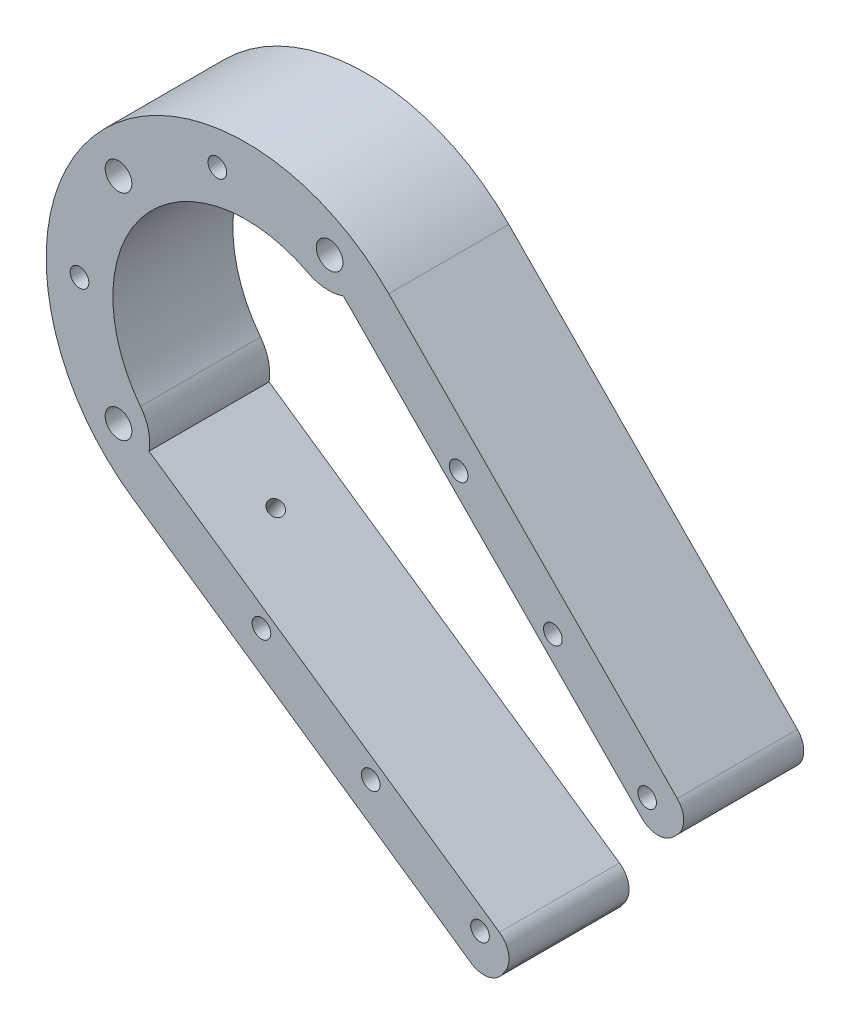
ISO-10303-21;
HEADER;
FILE_DESCRIPTION(('STEP AP214'),'2;1');
FILE_NAME('part.step','',(''),(''),'','','');
FILE_SCHEMA(('AUTOMOTIVE_DESIGN { 1 0 10303 214 1 1 1 1 }'));
ENDSEC;
DATA;
#1=APPLICATION_CONTEXT('core data for automotive mechanical design processes');
#2=APPLICATION_PROTOCOL_DEFINITION('international standard','automotive_design',2000,#1);
#3=PRODUCT_CONTEXT('',#1,'mechanical');
#4=PRODUCT('Part','Part','',(#3));
#5=PRODUCT_RELATED_PRODUCT_CATEGORY('part','',(#4));
#6=PRODUCT_DEFINITION_FORMATION('','',#4);
#7=PRODUCT_DEFINITION_CONTEXT('part definition',#1,'design');
#8=PRODUCT_DEFINITION('design','',#6,#7);
#9=PRODUCT_DEFINITION_SHAPE('','',#8);
#10=(LENGTH_UNIT() NAMED_UNIT(*) SI_UNIT(.MILLI.,.METRE.));
#11=(NAMED_UNIT(*) PLANE_ANGLE_UNIT() SI_UNIT($,.RADIAN.));
#12=(NAMED_UNIT(*) SI_UNIT($,.STERADIAN.) SOLID_ANGLE_UNIT());
#13=UNCERTAINTY_MEASURE_WITH_UNIT(LENGTH_MEASURE(1.E-05),#10,'distance_accuracy_value','');
#14=(GEOMETRIC_REPRESENTATION_CONTEXT(3) GLOBAL_UNCERTAINTY_ASSIGNED_CONTEXT((#13)) GLOBAL_UNIT_ASSIGNED_CONTEXT((#10,
#11,#12)) REPRESENTATION_CONTEXT('',''));
#15=CARTESIAN_POINT('',(0.,0.,0.));
#16=DIRECTION('',(0.,0.,1.));
#17=DIRECTION('',(1.,0.,0.));
#18=AXIS2_PLACEMENT_3D('',#15,#16,#17);
#19=CARTESIAN_POINT('',(18.75,32.4759526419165,9.999));
#20=DIRECTION('',(0.,0.,1.));
#21=DIRECTION('',(1.,0.,0.));
#22=AXIS2_PLACEMENT_3D('',#19,#20,#21);
#23=CYLINDRICAL_SURFACE('',#22,2.1);
#24=CARTESIAN_POINT('',(18.75,32.4759526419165,29.));
#25=DIRECTION('',(0.,0.,1.));
#26=DIRECTION('',(1.,0.,0.));
#27=AXIS2_PLACEMENT_3D('',#24,#25,#26);
#28=CIRCLE('',#27,2.1);
#29=CARTESIAN_POINT('',(20.85,32.4759526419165,29.));
#30=VERTEX_POINT('',#29);
#31=EDGE_CURVE('E195',#30,#30,#28,.F.);
#32=ORIENTED_EDGE('',*,*,#31,.F.);
#33=EDGE_LOOP('',(#32));
#34=FACE_BOUND('',#33,.T.);
#35=CARTESIAN_POINT('',(18.75,32.4759526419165,18.));
#36=DIRECTION('',(0.,0.,-1.));
#37=DIRECTION('',(-1.,0.,0.));
#38=AXIS2_PLACEMENT_3D('',#35,#36,#37);
#39=CIRCLE('',#38,2.1);
#40=CARTESIAN_POINT('',(16.65,32.4759526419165,18.));
#41=VERTEX_POINT('',#40);
#42=EDGE_CURVE('E45',#41,#41,#39,.F.);
#43=ORIENTED_EDGE('',*,*,#42,.F.);
#44=EDGE_LOOP('',(#43));
#45=FACE_BOUND('',#44,.T.);
#46=ADVANCED_FACE('F41',(#34,#45),#23,.F.);
#47=CARTESIAN_POINT('',(-28.7266666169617,24.1045353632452,9.999));
#48=DIRECTION('',(0.,0.,1.));
#49=DIRECTION('',(1.,0.,0.));
#50=AXIS2_PLACEMENT_3D('',#47,#48,#49);
#51=CYLINDRICAL_SURFACE('',#50,2.1);
#52=CARTESIAN_POINT('',(-28.7266666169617,24.1045353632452,29.));
#53=DIRECTION('',(0.,0.,1.));
#54=DIRECTION('',(1.,0.,0.));
#55=AXIS2_PLACEMENT_3D('',#52,#53,#54);
#56=CIRCLE('',#55,2.1);
#57=CARTESIAN_POINT('',(-26.6266666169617,24.1045353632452,29.));
#58=VERTEX_POINT('',#57);
#59=EDGE_CURVE('E191',#58,#58,#56,.F.);
#60=ORIENTED_EDGE('',*,*,#59,.F.);
#61=EDGE_LOOP('',(#60));
#62=FACE_BOUND('',#61,.T.);
#63=CARTESIAN_POINT('',(-28.7266666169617,24.1045353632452,18.));
#64=DIRECTION('',(0.,0.,-1.));
#65=DIRECTION('',(-1.,0.,0.));
#66=AXIS2_PLACEMENT_3D('',#63,#64,#65);
#67=CIRCLE('',#66,2.1);
#68=CARTESIAN_POINT('',(-30.8266666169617,24.1045353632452,18.));
#69=VERTEX_POINT('',#68);
#70=EDGE_CURVE('E206',#69,#69,#67,.F.);
#71=ORIENTED_EDGE('',*,*,#70,.F.);
#72=EDGE_LOOP('',(#71));
#73=FACE_BOUND('',#72,.T.);
#74=ADVANCED_FACE('F412',(#62,#73),#51,.F.);
#75=CARTESIAN_POINT('',(-28.7266666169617,-24.1045353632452,9.999));
#76=DIRECTION('',(0.,0.,1.));
#77=DIRECTION('',(1.,0.,0.));
#78=AXIS2_PLACEMENT_3D('',#75,#76,#77);
#79=CYLINDRICAL_SURFACE('',#78,2.1);
#80=CARTESIAN_POINT('',(-28.7266666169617,-24.1045353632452,29.));
#81=DIRECTION('',(0.,0.,1.));
#82=DIRECTION('',(1.,0.,0.));
#83=AXIS2_PLACEMENT_3D('',#80,#81,#82);
#84=CIRCLE('',#83,2.1);
#85=CARTESIAN_POINT('',(-26.6266666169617,-24.1045353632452,29.));
#86=VERTEX_POINT('',#85);
#87=EDGE_CURVE('E188',#86,#86,#84,.F.);
#88=ORIENTED_EDGE('',*,*,#87,.F.);
#89=EDGE_LOOP('',(#88));
#90=FACE_BOUND('',#89,.T.);
#91=CARTESIAN_POINT('',(-28.7266666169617,-24.1045353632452,18.));
#92=DIRECTION('',(0.,0.,-1.));
#93=DIRECTION('',(-1.,0.,0.));
#94=AXIS2_PLACEMENT_3D('',#91,#92,#93);
#95=CIRCLE('',#94,2.1);
#96=CARTESIAN_POINT('',(-30.8266666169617,-24.1045353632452,18.));
#97=VERTEX_POINT('',#96);
#98=EDGE_CURVE('E204',#97,#97,#95,.F.);
#99=ORIENTED_EDGE('',*,*,#98,.F.);
#100=EDGE_LOOP('',(#99));
#101=FACE_BOUND('',#100,.T.);
#102=ADVANCED_FACE('F419',(#90,#101),#79,.F.);
#103=CARTESIAN_POINT('',(65.0622498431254,67.977292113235,23.5));
#104=DIRECTION('',(-0.567441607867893,-0.823413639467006,0.));
#105=DIRECTION('',(0.823413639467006,-0.567441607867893,0.));
#106=AXIS2_PLACEMENT_3D('',#103,#104,#105);
#107=CYLINDRICAL_SURFACE('',#106,1.7);
#108=CARTESIAN_POINT('',(-6.85529783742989,-36.3821500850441,23.5));
#109=DIRECTION('',(-0.567441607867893,-0.823413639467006,0.));
#110=DIRECTION('',(0.823413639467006,-0.567441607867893,0.));
#111=AXIS2_PLACEMENT_3D('',#108,#109,#110);
#112=CIRCLE('',#111,1.7);
#113=CARTESIAN_POINT('',(-5.45549465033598,-37.3468008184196,23.5));
#114=VERTEX_POINT('',#113);
#115=EDGE_CURVE('E243',#114,#114,#112,.F.);
#116=ORIENTED_EDGE('',*,*,#115,.T.);
#117=EDGE_LOOP('',(#116));
#118=FACE_BOUND('',#117,.T.);
#119=CARTESIAN_POINT('',(-11.4813429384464,-43.0949969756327,23.5));
#120=DIRECTION('',(-0.567441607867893,-0.823413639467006,0.));
#121=DIRECTION('',(0.823413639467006,-0.567441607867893,0.));
#122=AXIS2_PLACEMENT_3D('',#119,#120,#121);
#123=CIRCLE('',#122,1.7);
#124=CARTESIAN_POINT('',(-10.0815397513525,-44.0596477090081,23.5));
#125=VERTEX_POINT('',#124);
#126=EDGE_CURVE('E198',#125,#125,#123,.T.);
#127=ORIENTED_EDGE('',*,*,#126,.T.);
#128=EDGE_LOOP('',(#127));
#129=FACE_BOUND('',#128,.T.);
#130=ADVANCED_FACE('F435',(#118,#129),#107,.F.);
#131=CARTESIAN_POINT('',(0.,0.,37.));
#132=DIRECTION('',(0.,0.,1.));
#133=DIRECTION('',(1.,0.,0.));
#134=AXIS2_PLACEMENT_3D('',#131,#132,#133);
#135=PLANE('',#134);
#136=CARTESIAN_POINT('',(18.75,32.4759526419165,37.));
#137=DIRECTION('',(0.,0.,1.));
#138=DIRECTION('',(1.,0.,0.));
#139=AXIS2_PLACEMENT_3D('',#136,#137,#138);
#140=CIRCLE('',#139,3.);
#141=CARTESIAN_POINT('',(21.75,32.4759526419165,37.));
#142=VERTEX_POINT('',#141);
#143=EDGE_CURVE('E223',#142,#142,#140,.T.);
#144=ORIENTED_EDGE('',*,*,#143,.F.);
#145=EDGE_LOOP('',(#144));
#146=FACE_BOUND('',#145,.T.);
#147=CARTESIAN_POINT('',(-28.7266666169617,24.1045353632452,37.));
#148=DIRECTION('',(0.,0.,1.));
#149=DIRECTION('',(1.,0.,0.));
#150=AXIS2_PLACEMENT_3D('',#147,#148,#149);
#151=CIRCLE('',#150,3.);
#152=CARTESIAN_POINT('',(-25.7266666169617,24.1045353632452,37.));
#153=VERTEX_POINT('',#152);
#154=EDGE_CURVE('E226',#153,#153,#151,.T.);
#155=ORIENTED_EDGE('',*,*,#154,.F.);
#156=EDGE_LOOP('',(#155));
#157=FACE_BOUND('',#156,.T.);
#158=CARTESIAN_POINT('',(-28.7266666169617,-24.1045353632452,37.));
#159=DIRECTION('',(0.,0.,1.));
#160=DIRECTION('',(1.,0.,0.));
#161=AXIS2_PLACEMENT_3D('',#158,#159,#160);
#162=CIRCLE('',#161,3.);
#163=CARTESIAN_POINT('',(-25.7266666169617,-24.1045353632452,37.));
#164=VERTEX_POINT('',#163);
#165=EDGE_CURVE('E232',#164,#164,#162,.T.);
#166=ORIENTED_EDGE('',*,*,#165,.F.);
#167=EDGE_LOOP('',(#166));
#168=FACE_BOUND('',#167,.T.);
#169=CARTESIAN_POINT('',(52.5843615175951,-82.298859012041,37.));
#170=DIRECTION('',(0.,0.,1.));
#171=DIRECTION('',(1.,0.,0.));
#172=AXIS2_PLACEMENT_3D('',#169,#170,#171);
#173=CIRCLE('',#172,2.1);
#174=CARTESIAN_POINT('',(54.6843615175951,-82.298859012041,37.));
#175=VERTEX_POINT('',#174);
#176=EDGE_CURVE('E249',#175,#175,#173,.T.);
#177=ORIENTED_EDGE('',*,*,#176,.F.);
#178=EDGE_LOOP('',(#177));
#179=FACE_BOUND('',#178,.T.);
#180=CARTESIAN_POINT('',(28.0038552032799,-65.1000593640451,37.));
#181=DIRECTION('',(0.,0.,1.));
#182=DIRECTION('',(1.,0.,0.));
#183=AXIS2_PLACEMENT_3D('',#180,#181,#182);
#184=CIRCLE('',#183,2.1);
#185=CARTESIAN_POINT('',(30.1038552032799,-65.1000593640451,37.));
#186=VERTEX_POINT('',#185);
#187=EDGE_CURVE('E253',#186,#186,#184,.T.);
#188=ORIENTED_EDGE('',*,*,#187,.F.);
#189=EDGE_LOOP('',(#188));
#190=FACE_BOUND('',#189,.T.);
#191=CARTESIAN_POINT('',(3.42334888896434,-47.9012597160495,37.));
#192=DIRECTION('',(0.,0.,1.));
#193=DIRECTION('',(1.,0.,0.));
#194=AXIS2_PLACEMENT_3D('',#191,#192,#193);
#195=CIRCLE('',#194,2.1);
#196=CARTESIAN_POINT('',(5.52334888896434,-47.9012597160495,37.));
#197=VERTEX_POINT('',#196);
#198=EDGE_CURVE('E260',#197,#197,#195,.T.);
#199=ORIENTED_EDGE('',*,*,#198,.F.);
#200=EDGE_LOOP('',(#199));
#201=FACE_BOUND('',#200,.T.);
#202=CARTESIAN_POINT('',(-37.5,0.,37.));
#203=DIRECTION('',(0.,0.,1.));
#204=DIRECTION('',(1.,0.,0.));
#205=AXIS2_PLACEMENT_3D('',#202,#203,#204);
#206=CIRCLE('',#205,2.1);
#207=CARTESIAN_POINT('',(-35.4,0.,37.));
#208=VERTEX_POINT('',#207);
#209=EDGE_CURVE('E266',#208,#208,#206,.T.);
#210=ORIENTED_EDGE('',*,*,#209,.F.);
#211=EDGE_LOOP('',(#210));
#212=FACE_BOUND('',#211,.T.);
#213=CARTESIAN_POINT('',(-6.51180666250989,36.9302907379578,37.));
#214=DIRECTION('',(0.,0.,1.));
#215=DIRECTION('',(1.,0.,0.));
#216=AXIS2_PLACEMENT_3D('',#213,#214,#215);
#217=CIRCLE('',#216,2.1);
#218=CARTESIAN_POINT('',(-4.41180666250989,36.9302907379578,37.));
#219=VERTEX_POINT('',#218);
#220=EDGE_CURVE('E272',#219,#219,#217,.T.);
#221=ORIENTED_EDGE('',*,*,#220,.F.);
#222=EDGE_LOOP('',(#221));
#223=FACE_BOUND('',#222,.T.);
#224=CARTESIAN_POINT('',(47.7679902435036,4.94662593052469,37.));
#225=DIRECTION('',(0.,0.,1.));
#226=DIRECTION('',(1.,0.,0.));
#227=AXIS2_PLACEMENT_3D('',#224,#225,#226);
#228=CIRCLE('',#227,2.1);
#229=CARTESIAN_POINT('',(49.8679902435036,4.94662593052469,37.));
#230=VERTEX_POINT('',#229);
#231=EDGE_CURVE('E278',#230,#230,#228,.T.);
#232=ORIENTED_EDGE('',*,*,#231,.F.);
#233=EDGE_LOOP('',(#232));
#234=FACE_BOUND('',#233,.T.);
#235=CARTESIAN_POINT('',(68.9738616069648,-16.2739070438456,37.));
#236=DIRECTION('',(0.,0.,1.));
#237=DIRECTION('',(1.,0.,0.));
#238=AXIS2_PLACEMENT_3D('',#235,#236,#237);
#239=CIRCLE('',#238,2.1);
#240=CARTESIAN_POINT('',(71.0738616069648,-16.2739070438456,37.));
#241=VERTEX_POINT('',#240);
#242=EDGE_CURVE('E284',#241,#241,#239,.T.);
#243=ORIENTED_EDGE('',*,*,#242,.F.);
#244=EDGE_LOOP('',(#243));
#245=FACE_BOUND('',#244,.T.);
#246=CARTESIAN_POINT('',(90.1797329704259,-37.4944400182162,37.));
#247=DIRECTION('',(0.,0.,1.));
#248=DIRECTION('',(1.,0.,0.));
#249=AXIS2_PLACEMENT_3D('',#246,#247,#248);
#250=CIRCLE('',#249,2.1);
#251=CARTESIAN_POINT('',(92.2797329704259,-37.4944400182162,37.));
#252=VERTEX_POINT('',#251);
#253=EDGE_CURVE('E290',#252,#252,#250,.T.);
#254=ORIENTED_EDGE('',*,*,#253,.F.);
#255=EDGE_LOOP('',(#254));
#256=FACE_BOUND('',#255,.T.);
#257=DIRECTION('',(-0.823413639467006,0.567441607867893,0.));
#258=VECTOR('',#257,1.);
#259=CARTESIAN_POINT('',(-21.8547787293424,-26.0455110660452,37.));
#260=LINE('',#259,#258);
#261=CARTESIAN_POINT('',(56.9479674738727,-80.3510931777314,37.));
#262=VERTEX_POINT('',#261);
#263=CARTESIAN_POINT('',(-21.8547787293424,-26.0455110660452,37.));
#264=VERTEX_POINT('',#263);
#265=EDGE_CURVE('E155',#262,#264,#260,.T.);
#266=ORIENTED_EDGE('',*,*,#265,.T.);
#267=CARTESIAN_POINT('',(-31.7144462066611,-24.3760928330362,37.));
#268=DIRECTION('',(0.,0.,1.));
#269=DIRECTION('',(1.,0.,0.));
#270=AXIS2_PLACEMENT_3D('',#267,#268,#269);
#271=CIRCLE('',#270,10.);
#272=CARTESIAN_POINT('',(-23.7858346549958,-18.2820696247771,37.));
#273=VERTEX_POINT('',#272);
#274=EDGE_CURVE('E143',#264,#273,#271,.T.);
#275=ORIENTED_EDGE('',*,*,#274,.T.);
#276=CARTESIAN_POINT('',(0.,0.,37.));
#277=DIRECTION('',(0.,0.,-1.));
#278=DIRECTION('',(1.,0.,0.));
#279=AXIS2_PLACEMENT_3D('',#276,#277,#278);
#280=CIRCLE('',#279,30.);
#281=CARTESIAN_POINT('',(13.8739570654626,26.5991224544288,37.));
#282=VERTEX_POINT('',#281);
#283=EDGE_CURVE('E212',#273,#282,#280,.T.);
#284=ORIENTED_EDGE('',*,*,#283,.T.);
#285=CARTESIAN_POINT('',(18.4986094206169,35.4654966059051,37.));
#286=DIRECTION('',(0.,0.,1.));
#287=DIRECTION('',(1.,0.,0.));
#288=AXIS2_PLACEMENT_3D('',#285,#286,#287);
#289=CIRCLE('',#288,10.);
#290=CARTESIAN_POINT('',(21.8547787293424,26.0455110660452,37.));
#291=VERTEX_POINT('',#290);
#292=EDGE_CURVE('E152',#282,#291,#289,.T.);
#293=ORIENTED_EDGE('',*,*,#292,.T.);
#294=DIRECTION('',(0.701805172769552,-0.712368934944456,0.));
#295=VECTOR('',#294,1.);
#296=CARTESIAN_POINT('',(21.8547787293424,26.0455110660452,37.));
#297=LINE('',#296,#295);
#298=CARTESIAN_POINT('',(89.0192902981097,-42.1299789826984,37.));
#299=VERTEX_POINT('',#298);
#300=EDGE_CURVE('E162',#291,#299,#297,.T.);
#301=ORIENTED_EDGE('',*,*,#300,.T.);
#302=CARTESIAN_POINT('',(92.581134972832,-38.6209531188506,37.));
#303=DIRECTION('',(0.,0.,1.));
#304=DIRECTION('',(1.,0.,0.));
#305=AXIS2_PLACEMENT_3D('',#302,#303,#304);
#306=CIRCLE('',#305,5.);
#307=CARTESIAN_POINT('',(96.0901608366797,-42.1827977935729,37.));
#308=VERTEX_POINT('',#307);
#309=EDGE_CURVE('E309',#299,#308,#306,.T.);
#310=ORIENTED_EDGE('',*,*,#309,.T.);
#311=DIRECTION('',(0.712368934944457,0.701805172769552,0.));
#312=VECTOR('',#311,1.);
#313=CARTESIAN_POINT('',(96.9111376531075,-41.3739952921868,37.));
#314=LINE('',#313,#312);
#315=CARTESIAN_POINT('',(96.9111376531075,-41.3739952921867,37.));
#316=VERTEX_POINT('',#315);
#317=EDGE_CURVE('E311',#308,#316,#314,.T.);
#318=ORIENTED_EDGE('',*,*,#317,.T.);
#319=CARTESIAN_POINT('',(93.4021117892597,-37.8121506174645,37.));
#320=DIRECTION('',(0.,0.,1.));
#321=DIRECTION('',(1.,0.,0.));
#322=AXIS2_PLACEMENT_3D('',#319,#320,#321);
#323=CIRCLE('',#322,5.);
#324=CARTESIAN_POINT('',(96.963956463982,-34.3031247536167,37.));
#325=VERTEX_POINT('',#324);
#326=EDGE_CURVE('E313',#316,#325,#323,.T.);
#327=ORIENTED_EDGE('',*,*,#326,.T.);
#328=DIRECTION('',(-0.701805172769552,0.712368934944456,0.));
#329=VECTOR('',#328,1.);
#330=CARTESIAN_POINT('',(32.0566020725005,31.5812327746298,37.));
#331=LINE('',#330,#329);
#332=CARTESIAN_POINT('',(32.0566020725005,31.5812327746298,37.));
#333=VERTEX_POINT('',#332);
#334=EDGE_CURVE('E315',#325,#333,#331,.T.);
#335=ORIENTED_EDGE('',*,*,#334,.T.);
#336=CARTESIAN_POINT('',(0.,0.,37.));
#337=DIRECTION('',(0.,0.,1.));
#338=DIRECTION('',(1.,0.,0.));
#339=AXIS2_PLACEMENT_3D('',#336,#337,#338);
#340=CIRCLE('',#339,45.);
#341=CARTESIAN_POINT('',(-25.5348723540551,-37.0536137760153,37.));
#342=VERTEX_POINT('',#341);
#343=EDGE_CURVE('E297',#333,#342,#340,.T.);
#344=ORIENTED_EDGE('',*,*,#343,.T.);
#345=DIRECTION('',(0.823413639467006,-0.567441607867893,0.));
#346=VECTOR('',#345,1.);
#347=CARTESIAN_POINT('',(-25.5348723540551,-37.0536137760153,37.));
#348=LINE('',#347,#346);
#349=CARTESIAN_POINT('',(50.6195975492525,-89.5341809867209,37.));
#350=VERTEX_POINT('',#349);
#351=EDGE_CURVE('E300',#342,#350,#348,.T.);
#352=ORIENTED_EDGE('',*,*,#351,.T.);
#353=CARTESIAN_POINT('',(53.456805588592,-85.4171127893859,37.));
#354=DIRECTION('',(0.,0.,1.));
#355=DIRECTION('',(1.,0.,0.));
#356=AXIS2_PLACEMENT_3D('',#353,#354,#355);
#357=CIRCLE('',#356,5.);
#358=CARTESIAN_POINT('',(57.573873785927,-88.2543208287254,37.));
#359=VERTEX_POINT('',#358);
#360=EDGE_CURVE('E303',#350,#359,#357,.T.);
#361=ORIENTED_EDGE('',*,*,#360,.T.);
#362=DIRECTION('',(0.567441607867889,0.823413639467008,0.));
#363=VECTOR('',#362,1.);
#364=CARTESIAN_POINT('',(58.2278276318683,-87.3053694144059,37.));
#365=LINE('',#364,#363);
#366=CARTESIAN_POINT('',(58.2278276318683,-87.3053694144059,37.));
#367=VERTEX_POINT('',#366);
#368=EDGE_CURVE('E305',#359,#367,#365,.T.);
#369=ORIENTED_EDGE('',*,*,#368,.T.);
#370=CARTESIAN_POINT('',(54.1107594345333,-84.4681613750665,37.));
#371=DIRECTION('',(0.,0.,1.));
#372=DIRECTION('',(-1.,0.,0.));
#373=AXIS2_PLACEMENT_3D('',#370,#371,#372);
#374=CIRCLE('',#373,5.);
#375=EDGE_CURVE('E158',#367,#262,#374,.T.);
#376=ORIENTED_EDGE('',*,*,#375,.T.);
#377=EDGE_LOOP('',(#266,#275,#284,#293,#301,#310,#318,#327,#335,#344,#352,#361,#369,#376));
#378=FACE_BOUND('',#377,.T.);
#379=ADVANCED_FACE('F156',(#146,#157,#168,#179,#190,#201,#212,#223,#234,#245,#256,#378),#135,.T.);
#380=CARTESIAN_POINT('',(0.,0.,10.));
#381=DIRECTION('',(0.,0.,1.));
#382=DIRECTION('',(1.,0.,0.));
#383=AXIS2_PLACEMENT_3D('',#380,#381,#382);
#384=PLANE('',#383);
#385=CARTESIAN_POINT('',(18.75,32.4759526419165,10.));
#386=DIRECTION('',(0.,0.,1.));
#387=DIRECTION('',(1.,0.,0.));
#388=AXIS2_PLACEMENT_3D('',#385,#386,#387);
#389=CIRCLE('',#388,3.);
#390=CARTESIAN_POINT('',(21.75,32.4759526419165,10.));
#391=VERTEX_POINT('',#390);
#392=EDGE_CURVE('E448',#391,#391,#389,.T.);
#393=ORIENTED_EDGE('',*,*,#392,.T.);
#394=EDGE_LOOP('',(#393));
#395=FACE_BOUND('',#394,.T.);
#396=CARTESIAN_POINT('',(-28.7266666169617,24.1045353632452,10.));
#397=DIRECTION('',(0.,0.,1.));
#398=DIRECTION('',(1.,0.,0.));
#399=AXIS2_PLACEMENT_3D('',#396,#397,#398);
#400=CIRCLE('',#399,3.);
#401=CARTESIAN_POINT('',(-25.7266666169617,24.1045353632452,10.));
#402=VERTEX_POINT('',#401);
#403=EDGE_CURVE('E452',#402,#402,#400,.T.);
#404=ORIENTED_EDGE('',*,*,#403,.T.);
#405=EDGE_LOOP('',(#404));
#406=FACE_BOUND('',#405,.T.);
#407=CARTESIAN_POINT('',(-28.7266666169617,-24.1045353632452,10.));
#408=DIRECTION('',(0.,0.,1.));
#409=DIRECTION('',(1.,0.,0.));
#410=AXIS2_PLACEMENT_3D('',#407,#408,#409);
#411=CIRCLE('',#410,3.);
#412=CARTESIAN_POINT('',(-25.7266666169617,-24.1045353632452,10.));
#413=VERTEX_POINT('',#412);
#414=EDGE_CURVE('E456',#413,#413,#411,.T.);
#415=ORIENTED_EDGE('',*,*,#414,.T.);
#416=EDGE_LOOP('',(#415));
#417=FACE_BOUND('',#416,.T.);
#418=CARTESIAN_POINT('',(52.5843615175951,-82.298859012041,10.));
#419=DIRECTION('',(0.,0.,1.));
#420=DIRECTION('',(1.,0.,0.));
#421=AXIS2_PLACEMENT_3D('',#418,#419,#420);
#422=CIRCLE('',#421,2.1);
#423=CARTESIAN_POINT('',(54.6843615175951,-82.298859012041,10.));
#424=VERTEX_POINT('',#423);
#425=EDGE_CURVE('E252',#424,#424,#422,.F.);
#426=ORIENTED_EDGE('',*,*,#425,.F.);
#427=EDGE_LOOP('',(#426));
#428=FACE_BOUND('',#427,.T.);
#429=CARTESIAN_POINT('',(28.0038552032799,-65.1000593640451,10.));
#430=DIRECTION('',(0.,0.,1.));
#431=DIRECTION('',(1.,0.,0.));
#432=AXIS2_PLACEMENT_3D('',#429,#430,#431);
#433=CIRCLE('',#432,2.1);
#434=CARTESIAN_POINT('',(30.1038552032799,-65.1000593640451,10.));
#435=VERTEX_POINT('',#434);
#436=EDGE_CURVE('E257',#435,#435,#433,.F.);
#437=ORIENTED_EDGE('',*,*,#436,.F.);
#438=EDGE_LOOP('',(#437));
#439=FACE_BOUND('',#438,.T.);
#440=CARTESIAN_POINT('',(3.42334888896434,-47.9012597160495,10.));
#441=DIRECTION('',(0.,0.,1.));
#442=DIRECTION('',(1.,0.,0.));
#443=AXIS2_PLACEMENT_3D('',#440,#441,#442);
#444=CIRCLE('',#443,2.1);
#445=CARTESIAN_POINT('',(5.52334888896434,-47.9012597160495,10.));
#446=VERTEX_POINT('',#445);
#447=EDGE_CURVE('E263',#446,#446,#444,.F.);
#448=ORIENTED_EDGE('',*,*,#447,.F.);
#449=EDGE_LOOP('',(#448));
#450=FACE_BOUND('',#449,.T.);
#451=CARTESIAN_POINT('',(-37.5,0.,10.));
#452=DIRECTION('',(0.,0.,1.));
#453=DIRECTION('',(1.,0.,0.));
#454=AXIS2_PLACEMENT_3D('',#451,#452,#453);
#455=CIRCLE('',#454,2.1);
#456=CARTESIAN_POINT('',(-35.4,0.,10.));
#457=VERTEX_POINT('',#456);
#458=EDGE_CURVE('E269',#457,#457,#455,.F.);
#459=ORIENTED_EDGE('',*,*,#458,.F.);
#460=EDGE_LOOP('',(#459));
#461=FACE_BOUND('',#460,.T.);
#462=CARTESIAN_POINT('',(-6.51180666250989,36.9302907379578,10.));
#463=DIRECTION('',(0.,0.,1.));
#464=DIRECTION('',(1.,0.,0.));
#465=AXIS2_PLACEMENT_3D('',#462,#463,#464);
#466=CIRCLE('',#465,2.1);
#467=CARTESIAN_POINT('',(-4.41180666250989,36.9302907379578,10.));
#468=VERTEX_POINT('',#467);
#469=EDGE_CURVE('E275',#468,#468,#466,.F.);
#470=ORIENTED_EDGE('',*,*,#469,.F.);
#471=EDGE_LOOP('',(#470));
#472=FACE_BOUND('',#471,.T.);
#473=CARTESIAN_POINT('',(47.7679902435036,4.94662593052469,10.));
#474=DIRECTION('',(0.,0.,1.));
#475=DIRECTION('',(1.,0.,0.));
#476=AXIS2_PLACEMENT_3D('',#473,#474,#475);
#477=CIRCLE('',#476,2.1);
#478=CARTESIAN_POINT('',(49.8679902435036,4.94662593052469,10.));
#479=VERTEX_POINT('',#478);
#480=EDGE_CURVE('E281',#479,#479,#477,.F.);
#481=ORIENTED_EDGE('',*,*,#480,.F.);
#482=EDGE_LOOP('',(#481));
#483=FACE_BOUND('',#482,.T.);
#484=CARTESIAN_POINT('',(68.9738616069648,-16.2739070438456,10.));
#485=DIRECTION('',(0.,0.,1.));
#486=DIRECTION('',(1.,0.,0.));
#487=AXIS2_PLACEMENT_3D('',#484,#485,#486);
#488=CIRCLE('',#487,2.1);
#489=CARTESIAN_POINT('',(71.0738616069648,-16.2739070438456,10.));
#490=VERTEX_POINT('',#489);
#491=EDGE_CURVE('E287',#490,#490,#488,.F.);
#492=ORIENTED_EDGE('',*,*,#491,.F.);
#493=EDGE_LOOP('',(#492));
#494=FACE_BOUND('',#493,.T.);
#495=CARTESIAN_POINT('',(90.1797329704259,-37.4944400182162,10.));
#496=DIRECTION('',(0.,0.,1.));
#497=DIRECTION('',(1.,0.,0.));
#498=AXIS2_PLACEMENT_3D('',#495,#496,#497);
#499=CIRCLE('',#498,2.1);
#500=CARTESIAN_POINT('',(92.2797329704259,-37.4944400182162,10.));
#501=VERTEX_POINT('',#500);
#502=EDGE_CURVE('E248',#501,#501,#499,.F.);
#503=ORIENTED_EDGE('',*,*,#502,.F.);
#504=EDGE_LOOP('',(#503));
#505=FACE_BOUND('',#504,.T.);
#506=CARTESIAN_POINT('',(0.,0.,9.99999999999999));
#507=DIRECTION('',(0.,0.,1.));
#508=DIRECTION('',(1.,0.,0.));
#509=AXIS2_PLACEMENT_3D('',#506,#507,#508);
#510=CIRCLE('',#509,30.);
#511=CARTESIAN_POINT('',(13.8739570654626,26.5991224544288,9.99999999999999));
#512=VERTEX_POINT('',#511);
#513=CARTESIAN_POINT('',(-23.7858346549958,-18.2820696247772,9.99999999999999));
#514=VERTEX_POINT('',#513);
#515=EDGE_CURVE('E215',#512,#514,#510,.T.);
#516=ORIENTED_EDGE('',*,*,#515,.T.);
#517=CARTESIAN_POINT('',(-31.7144462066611,-24.3760928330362,9.99999999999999));
#518=DIRECTION('',(0.,0.,1.));
#519=DIRECTION('',(1.,0.,0.));
#520=AXIS2_PLACEMENT_3D('',#517,#518,#519);
#521=CIRCLE('',#520,10.);
#522=CARTESIAN_POINT('',(-21.8547787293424,-26.0455110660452,9.99999999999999));
#523=VERTEX_POINT('',#522);
#524=EDGE_CURVE('E11',#514,#523,#521,.F.);
#525=ORIENTED_EDGE('',*,*,#524,.T.);
#526=DIRECTION('',(-0.823413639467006,0.567441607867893,0.));
#527=VECTOR('',#526,1.);
#528=CARTESIAN_POINT('',(-21.8547787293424,-26.0455110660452,10.));
#529=LINE('',#528,#527);
#530=CARTESIAN_POINT('',(56.9479674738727,-80.3510931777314,10.));
#531=VERTEX_POINT('',#530);
#532=EDGE_CURVE('E167',#531,#523,#529,.T.);
#533=ORIENTED_EDGE('',*,*,#532,.F.);
#534=CARTESIAN_POINT('',(54.1107594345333,-84.4681613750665,10.));
#535=DIRECTION('',(0.,0.,1.));
#536=DIRECTION('',(-1.,0.,0.));
#537=AXIS2_PLACEMENT_3D('',#534,#535,#536);
#538=CIRCLE('',#537,5.);
#539=CARTESIAN_POINT('',(58.2278276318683,-87.3053694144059,10.));
#540=VERTEX_POINT('',#539);
#541=EDGE_CURVE('E326',#540,#531,#538,.T.);
#542=ORIENTED_EDGE('',*,*,#541,.F.);
#543=DIRECTION('',(0.567441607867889,0.823413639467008,0.));
#544=VECTOR('',#543,1.);
#545=CARTESIAN_POINT('',(58.2278276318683,-87.3053694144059,10.));
#546=LINE('',#545,#544);
#547=CARTESIAN_POINT('',(57.573873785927,-88.2543208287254,10.));
#548=VERTEX_POINT('',#547);
#549=EDGE_CURVE('E324',#548,#540,#546,.T.);
#550=ORIENTED_EDGE('',*,*,#549,.F.);
#551=CARTESIAN_POINT('',(53.456805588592,-85.4171127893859,10.));
#552=DIRECTION('',(0.,0.,1.));
#553=DIRECTION('',(1.,0.,0.));
#554=AXIS2_PLACEMENT_3D('',#551,#552,#553);
#555=CIRCLE('',#554,5.);
#556=CARTESIAN_POINT('',(50.6195975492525,-89.5341809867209,10.));
#557=VERTEX_POINT('',#556);
#558=EDGE_CURVE('E322',#557,#548,#555,.T.);
#559=ORIENTED_EDGE('',*,*,#558,.F.);
#560=DIRECTION('',(0.823413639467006,-0.567441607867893,0.));
#561=VECTOR('',#560,1.);
#562=CARTESIAN_POINT('',(-25.5348723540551,-37.0536137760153,10.));
#563=LINE('',#562,#561);
#564=CARTESIAN_POINT('',(-25.5348723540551,-37.0536137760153,10.));
#565=VERTEX_POINT('',#564);
#566=EDGE_CURVE('E320',#565,#557,#563,.T.);
#567=ORIENTED_EDGE('',*,*,#566,.F.);
#568=CARTESIAN_POINT('',(0.,0.,10.));
#569=DIRECTION('',(0.,0.,1.));
#570=DIRECTION('',(1.,0.,0.));
#571=AXIS2_PLACEMENT_3D('',#568,#569,#570);
#572=CIRCLE('',#571,45.);
#573=CARTESIAN_POINT('',(32.0566020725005,31.5812327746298,10.));
#574=VERTEX_POINT('',#573);
#575=EDGE_CURVE('E256',#574,#565,#572,.T.);
#576=ORIENTED_EDGE('',*,*,#575,.F.);
#577=DIRECTION('',(-0.701805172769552,0.712368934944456,0.));
#578=VECTOR('',#577,1.);
#579=CARTESIAN_POINT('',(32.0566020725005,31.5812327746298,10.));
#580=LINE('',#579,#578);
#581=CARTESIAN_POINT('',(96.963956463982,-34.3031247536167,10.));
#582=VERTEX_POINT('',#581);
#583=EDGE_CURVE('E301',#582,#574,#580,.T.);
#584=ORIENTED_EDGE('',*,*,#583,.F.);
#585=CARTESIAN_POINT('',(93.4021117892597,-37.8121506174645,10.));
#586=DIRECTION('',(0.,0.,1.));
#587=DIRECTION('',(1.,0.,0.));
#588=AXIS2_PLACEMENT_3D('',#585,#586,#587);
#589=CIRCLE('',#588,5.);
#590=CARTESIAN_POINT('',(96.9111376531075,-41.3739952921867,10.));
#591=VERTEX_POINT('',#590);
#592=EDGE_CURVE('E335',#591,#582,#589,.T.);
#593=ORIENTED_EDGE('',*,*,#592,.F.);
#594=DIRECTION('',(0.712368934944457,0.701805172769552,0.));
#595=VECTOR('',#594,1.);
#596=CARTESIAN_POINT('',(96.9111376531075,-41.3739952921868,10.));
#597=LINE('',#596,#595);
#598=CARTESIAN_POINT('',(96.0901608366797,-42.1827977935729,10.));
#599=VERTEX_POINT('',#598);
#600=EDGE_CURVE('E333',#599,#591,#597,.T.);
#601=ORIENTED_EDGE('',*,*,#600,.F.);
#602=CARTESIAN_POINT('',(92.581134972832,-38.6209531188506,10.));
#603=DIRECTION('',(0.,0.,1.));
#604=DIRECTION('',(1.,0.,0.));
#605=AXIS2_PLACEMENT_3D('',#602,#603,#604);
#606=CIRCLE('',#605,5.);
#607=CARTESIAN_POINT('',(89.0192902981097,-42.1299789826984,10.));
#608=VERTEX_POINT('',#607);
#609=EDGE_CURVE('E331',#608,#599,#606,.T.);
#610=ORIENTED_EDGE('',*,*,#609,.F.);
#611=DIRECTION('',(0.701805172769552,-0.712368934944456,0.));
#612=VECTOR('',#611,1.);
#613=CARTESIAN_POINT('',(21.8547787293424,26.0455110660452,10.));
#614=LINE('',#613,#612);
#615=CARTESIAN_POINT('',(21.8547787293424,26.0455110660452,10.));
#616=VERTEX_POINT('',#615);
#617=EDGE_CURVE('E329',#616,#608,#614,.T.);
#618=ORIENTED_EDGE('',*,*,#617,.F.);
#619=CARTESIAN_POINT('',(18.4986094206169,35.4654966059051,9.99999999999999));
#620=DIRECTION('',(0.,0.,1.));
#621=DIRECTION('',(1.,0.,0.));
#622=AXIS2_PLACEMENT_3D('',#619,#620,#621);
#623=CIRCLE('',#622,10.);
#624=EDGE_CURVE('E50',#616,#512,#623,.F.);
#625=ORIENTED_EDGE('',*,*,#624,.T.);
#626=EDGE_LOOP('',(#516,#525,#533,#542,#550,#559,#567,#576,#584,#593,#601,#610,#618,#625));
#627=FACE_BOUND('',#626,.T.);
#628=ADVANCED_FACE('F358',(#395,#406,#417,#428,#439,#450,#461,#472,#483,#494,#505,#627),#384,.F.);
#629=CARTESIAN_POINT('',(0.,0.,37.));
#630=DIRECTION('',(0.,0.,-1.));
#631=DIRECTION('',(-1.,0.,0.));
#632=AXIS2_PLACEMENT_3D('',#629,#630,#631);
#633=CYLINDRICAL_SURFACE('',#632,45.);
#634=ORIENTED_EDGE('',*,*,#575,.T.);
#635=DIRECTION('',(0.,0.,-1.));
#636=VECTOR('',#635,1.);
#637=CARTESIAN_POINT('',(-25.5348723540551,-37.0536137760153,37.));
#638=LINE('',#637,#636);
#639=EDGE_CURVE('E185',#342,#565,#638,.T.);
#640=ORIENTED_EDGE('',*,*,#639,.F.);
#641=ORIENTED_EDGE('',*,*,#343,.F.);
#642=DIRECTION('',(0.,0.,-1.));
#643=VECTOR('',#642,1.);
#644=CARTESIAN_POINT('',(32.0566020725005,31.5812327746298,37.));
#645=LINE('',#644,#643);
#646=EDGE_CURVE('E317',#333,#574,#645,.T.);
#647=ORIENTED_EDGE('',*,*,#646,.T.);
#648=EDGE_LOOP('',(#634,#640,#641,#647));
#649=FACE_BOUND('',#648,.T.);
#650=ADVANCED_FACE('F396',(#649),#633,.T.);
#651=CARTESIAN_POINT('',(-25.5348723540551,-37.0536137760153,37.));
#652=DIRECTION('',(0.567441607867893,0.823413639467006,0.));
#653=DIRECTION('',(-0.823413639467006,0.567441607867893,0.));
#654=AXIS2_PLACEMENT_3D('',#651,#652,#653);
#655=PLANE('',#654);
#656=CARTESIAN_POINT('',(-13.1836677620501,-45.5652378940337,23.5));
#657=DIRECTION('',(-0.567441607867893,-0.823413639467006,0.));
#658=DIRECTION('',(0.823413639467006,-0.567441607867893,0.));
#659=AXIS2_PLACEMENT_3D('',#656,#657,#658);
#660=CIRCLE('',#659,3.);
#661=CARTESIAN_POINT('',(-10.7134268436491,-47.2675627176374,23.5));
#662=VERTEX_POINT('',#661);
#663=EDGE_CURVE('E239',#662,#662,#660,.T.);
#664=ORIENTED_EDGE('',*,*,#663,.F.);
#665=EDGE_LOOP('',(#664));
#666=FACE_BOUND('',#665,.T.);
#667=ORIENTED_EDGE('',*,*,#566,.T.);
#668=DIRECTION('',(0.,0.,-1.));
#669=VECTOR('',#668,1.);
#670=CARTESIAN_POINT('',(50.6195975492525,-89.5341809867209,37.));
#671=LINE('',#670,#669);
#672=EDGE_CURVE('E182',#350,#557,#671,.T.);
#673=ORIENTED_EDGE('',*,*,#672,.F.);
#674=ORIENTED_EDGE('',*,*,#351,.F.);
#675=ORIENTED_EDGE('',*,*,#639,.T.);
#676=EDGE_LOOP('',(#667,#673,#674,#675));
#677=FACE_BOUND('',#676,.T.);
#678=ADVANCED_FACE('F393',(#666,#677),#655,.F.);
#679=CARTESIAN_POINT('',(53.456805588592,-85.4171127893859,37.));
#680=DIRECTION('',(0.,0.,-1.));
#681=DIRECTION('',(-1.,0.,0.));
#682=AXIS2_PLACEMENT_3D('',#679,#680,#681);
#683=CYLINDRICAL_SURFACE('',#682,5.);
#684=ORIENTED_EDGE('',*,*,#558,.T.);
#685=DIRECTION('',(0.,0.,-1.));
#686=VECTOR('',#685,1.);
#687=CARTESIAN_POINT('',(57.573873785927,-88.2543208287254,37.));
#688=LINE('',#687,#686);
#689=EDGE_CURVE('E179',#359,#548,#688,.T.);
#690=ORIENTED_EDGE('',*,*,#689,.F.);
#691=ORIENTED_EDGE('',*,*,#360,.F.);
#692=ORIENTED_EDGE('',*,*,#672,.T.);
#693=EDGE_LOOP('',(#684,#690,#691,#692));
#694=FACE_BOUND('',#693,.T.);
#695=ADVANCED_FACE('F388',(#694),#683,.T.);
#696=CARTESIAN_POINT('',(58.2278276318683,-87.3053694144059,37.));
#697=DIRECTION('',(-0.823413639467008,0.567441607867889,0.));
#698=DIRECTION('',(-0.567441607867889,-0.823413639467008,0.));
#699=AXIS2_PLACEMENT_3D('',#696,#697,#698);
#700=PLANE('',#699);
#701=ORIENTED_EDGE('',*,*,#549,.T.);
#702=DIRECTION('',(0.,0.,-1.));
#703=VECTOR('',#702,1.);
#704=CARTESIAN_POINT('',(58.2278276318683,-87.3053694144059,37.));
#705=LINE('',#704,#703);
#706=EDGE_CURVE('E171',#367,#540,#705,.T.);
#707=ORIENTED_EDGE('',*,*,#706,.F.);
#708=ORIENTED_EDGE('',*,*,#368,.F.);
#709=ORIENTED_EDGE('',*,*,#689,.T.);
#710=EDGE_LOOP('',(#701,#707,#708,#709));
#711=FACE_BOUND('',#710,.T.);
#712=ADVANCED_FACE('F384',(#711),#700,.F.);
#713=CARTESIAN_POINT('',(54.1107594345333,-84.4681613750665,37.));
#714=DIRECTION('',(0.,0.,-1.));
#715=DIRECTION('',(-1.,0.,0.));
#716=AXIS2_PLACEMENT_3D('',#713,#714,#715);
#717=CYLINDRICAL_SURFACE('',#716,5.);
#718=ORIENTED_EDGE('',*,*,#541,.T.);
#719=DIRECTION('',(0.,0.,-1.));
#720=VECTOR('',#719,1.);
#721=CARTESIAN_POINT('',(56.9479674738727,-80.3510931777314,37.));
#722=LINE('',#721,#720);
#723=EDGE_CURVE('E168',#262,#531,#722,.T.);
#724=ORIENTED_EDGE('',*,*,#723,.F.);
#725=ORIENTED_EDGE('',*,*,#375,.F.);
#726=ORIENTED_EDGE('',*,*,#706,.T.);
#727=EDGE_LOOP('',(#718,#724,#725,#726));
#728=FACE_BOUND('',#727,.T.);
#729=ADVANCED_FACE('F380',(#728),#717,.T.);
#730=CARTESIAN_POINT('',(-21.8547787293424,-26.0455110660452,37.));
#731=DIRECTION('',(-0.567441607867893,-0.823413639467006,0.));
#732=DIRECTION('',(0.823413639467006,-0.567441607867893,0.));
#733=AXIS2_PLACEMENT_3D('',#730,#731,#732);
#734=PLANE('',#733);
#735=ORIENTED_EDGE('',*,*,#115,.F.);
#736=EDGE_LOOP('',(#735));
#737=FACE_BOUND('',#736,.T.);
#738=ORIENTED_EDGE('',*,*,#532,.T.);
#739=DIRECTION('',(0.,0.,-1.));
#740=VECTOR('',#739,1.);
#741=CARTESIAN_POINT('',(-21.8547787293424,-26.0455110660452,37.));
#742=LINE('',#741,#740);
#743=EDGE_CURVE('E148',#264,#523,#742,.T.);
#744=ORIENTED_EDGE('',*,*,#743,.F.);
#745=ORIENTED_EDGE('',*,*,#265,.F.);
#746=ORIENTED_EDGE('',*,*,#723,.T.);
#747=EDGE_LOOP('',(#738,#744,#745,#746));
#748=FACE_BOUND('',#747,.T.);
#749=ADVANCED_FACE('F165',(#737,#748),#734,.F.);
#750=CARTESIAN_POINT('',(21.8547787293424,26.0455110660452,37.));
#751=DIRECTION('',(0.712368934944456,0.701805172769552,0.));
#752=DIRECTION('',(-0.701805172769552,0.712368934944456,0.));
#753=AXIS2_PLACEMENT_3D('',#750,#751,#752);
#754=PLANE('',#753);
#755=ORIENTED_EDGE('',*,*,#617,.T.);
#756=DIRECTION('',(0.,0.,-1.));
#757=VECTOR('',#756,1.);
#758=CARTESIAN_POINT('',(89.0192902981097,-42.1299789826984,37.));
#759=LINE('',#758,#757);
#760=EDGE_CURVE('E173',#299,#608,#759,.T.);
#761=ORIENTED_EDGE('',*,*,#760,.F.);
#762=ORIENTED_EDGE('',*,*,#300,.F.);
#763=DIRECTION('',(0.,0.,-1.));
#764=VECTOR('',#763,1.);
#765=CARTESIAN_POINT('',(21.8547787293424,26.0455110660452,37.));
#766=LINE('',#765,#764);
#767=EDGE_CURVE('E169',#291,#616,#766,.T.);
#768=ORIENTED_EDGE('',*,*,#767,.T.);
#769=EDGE_LOOP('',(#755,#761,#762,#768));
#770=FACE_BOUND('',#769,.T.);
#771=ADVANCED_FACE('F372',(#770),#754,.F.);
#772=CARTESIAN_POINT('',(92.581134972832,-38.6209531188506,37.));
#773=DIRECTION('',(0.,0.,-1.));
#774=DIRECTION('',(-1.,0.,0.));
#775=AXIS2_PLACEMENT_3D('',#772,#773,#774);
#776=CYLINDRICAL_SURFACE('',#775,5.);
#777=ORIENTED_EDGE('',*,*,#609,.T.);
#778=DIRECTION('',(0.,0.,-1.));
#779=VECTOR('',#778,1.);
#780=CARTESIAN_POINT('',(96.0901608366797,-42.1827977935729,37.));
#781=LINE('',#780,#779);
#782=EDGE_CURVE('E346',#308,#599,#781,.T.);
#783=ORIENTED_EDGE('',*,*,#782,.F.);
#784=ORIENTED_EDGE('',*,*,#309,.F.);
#785=ORIENTED_EDGE('',*,*,#760,.T.);
#786=EDGE_LOOP('',(#777,#783,#784,#785));
#787=FACE_BOUND('',#786,.T.);
#788=ADVANCED_FACE('F353',(#787),#776,.T.);
#789=CARTESIAN_POINT('',(96.9111376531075,-41.3739952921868,37.));
#790=DIRECTION('',(-0.701805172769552,0.712368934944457,0.));
#791=DIRECTION('',(-0.712368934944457,-0.701805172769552,0.));
#792=AXIS2_PLACEMENT_3D('',#789,#790,#791);
#793=PLANE('',#792);
#794=ORIENTED_EDGE('',*,*,#600,.T.);
#795=DIRECTION('',(0.,0.,-1.));
#796=VECTOR('',#795,1.);
#797=CARTESIAN_POINT('',(96.9111376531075,-41.3739952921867,37.));
#798=LINE('',#797,#796);
#799=EDGE_CURVE('E343',#316,#591,#798,.T.);
#800=ORIENTED_EDGE('',*,*,#799,.F.);
#801=ORIENTED_EDGE('',*,*,#317,.F.);
#802=ORIENTED_EDGE('',*,*,#782,.T.);
#803=EDGE_LOOP('',(#794,#800,#801,#802));
#804=FACE_BOUND('',#803,.T.);
#805=ADVANCED_FACE('F363',(#804),#793,.F.);
#806=CARTESIAN_POINT('',(93.4021117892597,-37.8121506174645,37.));
#807=DIRECTION('',(0.,0.,-1.));
#808=DIRECTION('',(-1.,0.,0.));
#809=AXIS2_PLACEMENT_3D('',#806,#807,#808);
#810=CYLINDRICAL_SURFACE('',#809,5.);
#811=ORIENTED_EDGE('',*,*,#592,.T.);
#812=DIRECTION('',(0.,0.,-1.));
#813=VECTOR('',#812,1.);
#814=CARTESIAN_POINT('',(96.963956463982,-34.3031247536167,37.));
#815=LINE('',#814,#813);
#816=EDGE_CURVE('E340',#325,#582,#815,.T.);
#817=ORIENTED_EDGE('',*,*,#816,.F.);
#818=ORIENTED_EDGE('',*,*,#326,.F.);
#819=ORIENTED_EDGE('',*,*,#799,.T.);
#820=EDGE_LOOP('',(#811,#817,#818,#819));
#821=FACE_BOUND('',#820,.T.);
#822=ADVANCED_FACE('F367',(#821),#810,.T.);
#823=CARTESIAN_POINT('',(32.0566020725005,31.5812327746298,37.));
#824=DIRECTION('',(-0.712368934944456,-0.701805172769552,0.));
#825=DIRECTION('',(0.701805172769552,-0.712368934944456,0.));
#826=AXIS2_PLACEMENT_3D('',#823,#824,#825);
#827=PLANE('',#826);
#828=ORIENTED_EDGE('',*,*,#583,.T.);
#829=ORIENTED_EDGE('',*,*,#646,.F.);
#830=ORIENTED_EDGE('',*,*,#334,.F.);
#831=ORIENTED_EDGE('',*,*,#816,.T.);
#832=EDGE_LOOP('',(#828,#829,#830,#831));
#833=FACE_BOUND('',#832,.T.);
#834=ADVANCED_FACE('F398',(#833),#827,.F.);
#835=CARTESIAN_POINT('',(90.1797329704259,-37.4944400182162,9.999));
#836=DIRECTION('',(0.,0.,1.));
#837=DIRECTION('',(1.,0.,0.));
#838=AXIS2_PLACEMENT_3D('',#835,#836,#837);
#839=CYLINDRICAL_SURFACE('',#838,2.1);
#840=ORIENTED_EDGE('',*,*,#253,.T.);
#841=EDGE_LOOP('',(#840));
#842=FACE_BOUND('',#841,.T.);
#843=ORIENTED_EDGE('',*,*,#502,.T.);
#844=EDGE_LOOP('',(#843));
#845=FACE_BOUND('',#844,.T.);
#846=ADVANCED_FACE('F400',(#842,#845),#839,.F.);
#847=CARTESIAN_POINT('',(68.9738616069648,-16.2739070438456,9.999));
#848=DIRECTION('',(0.,0.,1.));
#849=DIRECTION('',(1.,0.,0.));
#850=AXIS2_PLACEMENT_3D('',#847,#848,#849);
#851=CYLINDRICAL_SURFACE('',#850,2.1);
#852=ORIENTED_EDGE('',*,*,#242,.T.);
#853=EDGE_LOOP('',(#852));
#854=FACE_BOUND('',#853,.T.);
#855=ORIENTED_EDGE('',*,*,#491,.T.);
#856=EDGE_LOOP('',(#855));
#857=FACE_BOUND('',#856,.T.);
#858=ADVANCED_FACE('F406',(#854,#857),#851,.F.);
#859=CARTESIAN_POINT('',(47.7679902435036,4.94662593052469,9.999));
#860=DIRECTION('',(0.,0.,1.));
#861=DIRECTION('',(1.,0.,0.));
#862=AXIS2_PLACEMENT_3D('',#859,#860,#861);
#863=CYLINDRICAL_SURFACE('',#862,2.1);
#864=ORIENTED_EDGE('',*,*,#231,.T.);
#865=EDGE_LOOP('',(#864));
#866=FACE_BOUND('',#865,.T.);
#867=ORIENTED_EDGE('',*,*,#480,.T.);
#868=EDGE_LOOP('',(#867));
#869=FACE_BOUND('',#868,.T.);
#870=ADVANCED_FACE('F427',(#866,#869),#863,.F.);
#871=CARTESIAN_POINT('',(-6.51180666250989,36.9302907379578,9.999));
#872=DIRECTION('',(0.,0.,1.));
#873=DIRECTION('',(1.,0.,0.));
#874=AXIS2_PLACEMENT_3D('',#871,#872,#873);
#875=CYLINDRICAL_SURFACE('',#874,2.1);
#876=ORIENTED_EDGE('',*,*,#220,.T.);
#877=EDGE_LOOP('',(#876));
#878=FACE_BOUND('',#877,.T.);
#879=ORIENTED_EDGE('',*,*,#469,.T.);
#880=EDGE_LOOP('',(#879));
#881=FACE_BOUND('',#880,.T.);
#882=ADVANCED_FACE('F426',(#878,#881),#875,.F.);
#883=CARTESIAN_POINT('',(-37.5,0.,9.999));
#884=DIRECTION('',(0.,0.,1.));
#885=DIRECTION('',(1.,0.,0.));
#886=AXIS2_PLACEMENT_3D('',#883,#884,#885);
#887=CYLINDRICAL_SURFACE('',#886,2.1);
#888=ORIENTED_EDGE('',*,*,#209,.T.);
#889=EDGE_LOOP('',(#888));
#890=FACE_BOUND('',#889,.T.);
#891=ORIENTED_EDGE('',*,*,#458,.T.);
#892=EDGE_LOOP('',(#891));
#893=FACE_BOUND('',#892,.T.);
#894=ADVANCED_FACE('F477',(#890,#893),#887,.F.);
#895=CARTESIAN_POINT('',(3.42334888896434,-47.9012597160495,9.999));
#896=DIRECTION('',(0.,0.,1.));
#897=DIRECTION('',(1.,0.,0.));
#898=AXIS2_PLACEMENT_3D('',#895,#896,#897);
#899=CYLINDRICAL_SURFACE('',#898,2.1);
#900=ORIENTED_EDGE('',*,*,#198,.T.);
#901=EDGE_LOOP('',(#900));
#902=FACE_BOUND('',#901,.T.);
#903=ORIENTED_EDGE('',*,*,#447,.T.);
#904=EDGE_LOOP('',(#903));
#905=FACE_BOUND('',#904,.T.);
#906=ADVANCED_FACE('F482',(#902,#905),#899,.F.);
#907=CARTESIAN_POINT('',(28.0038552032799,-65.1000593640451,9.999));
#908=DIRECTION('',(0.,0.,1.));
#909=DIRECTION('',(1.,0.,0.));
#910=AXIS2_PLACEMENT_3D('',#907,#908,#909);
#911=CYLINDRICAL_SURFACE('',#910,2.1);
#912=ORIENTED_EDGE('',*,*,#187,.T.);
#913=EDGE_LOOP('',(#912));
#914=FACE_BOUND('',#913,.T.);
#915=ORIENTED_EDGE('',*,*,#436,.T.);
#916=EDGE_LOOP('',(#915));
#917=FACE_BOUND('',#916,.T.);
#918=ADVANCED_FACE('F496',(#914,#917),#911,.F.);
#919=CARTESIAN_POINT('',(52.5843615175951,-82.298859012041,9.999));
#920=DIRECTION('',(0.,0.,1.));
#921=DIRECTION('',(1.,0.,0.));
#922=AXIS2_PLACEMENT_3D('',#919,#920,#921);
#923=CYLINDRICAL_SURFACE('',#922,2.1);
#924=ORIENTED_EDGE('',*,*,#176,.T.);
#925=EDGE_LOOP('',(#924));
#926=FACE_BOUND('',#925,.T.);
#927=ORIENTED_EDGE('',*,*,#425,.T.);
#928=EDGE_LOOP('',(#927));
#929=FACE_BOUND('',#928,.T.);
#930=ADVANCED_FACE('F505',(#926,#929),#923,.F.);
#931=CARTESIAN_POINT('',(-11.4813429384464,-43.0949969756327,23.5));
#932=DIRECTION('',(-0.567441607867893,-0.823413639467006,0.));
#933=DIRECTION('',(0.823413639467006,-0.567441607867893,0.));
#934=AXIS2_PLACEMENT_3D('',#931,#932,#933);
#935=CYLINDRICAL_SURFACE('',#934,3.);
#936=CARTESIAN_POINT('',(-11.4813429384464,-43.0949969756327,23.5));
#937=DIRECTION('',(-0.567441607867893,-0.823413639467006,0.));
#938=DIRECTION('',(0.823413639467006,-0.567441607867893,0.));
#939=AXIS2_PLACEMENT_3D('',#936,#937,#938);
#940=CIRCLE('',#939,3.);
#941=CARTESIAN_POINT('',(-9.0111020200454,-44.7973217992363,23.5));
#942=VERTEX_POINT('',#941);
#943=EDGE_CURVE('E240',#942,#942,#940,.T.);
#944=CARTESIAN_POINT('',(-9.0111020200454,-44.7973217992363,23.5));
#945=CARTESIAN_POINT('',(-9.02883457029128,-44.8230534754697,23.5));
#946=CARTESIAN_POINT('',(-9.04656712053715,-44.848785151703,23.5));
#947=CARTESIAN_POINT('',(-9.08203222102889,-44.9002485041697,23.5));
#948=CARTESIAN_POINT('',(-9.09976477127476,-44.9259801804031,23.5));
#949=CARTESIAN_POINT('',(-9.13522987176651,-44.9774435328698,23.5));
#950=CARTESIAN_POINT('',(-9.15296242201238,-45.0031752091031,23.5));
#951=CARTESIAN_POINT('',(-9.18842752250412,-45.0546385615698,23.5));
#952=CARTESIAN_POINT('',(-9.20616007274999,-45.0803702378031,23.5));
#953=CARTESIAN_POINT('',(-9.24162517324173,-45.1318335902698,23.5));
#954=CARTESIAN_POINT('',(-9.25935772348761,-45.1575652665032,23.5));
#955=CARTESIAN_POINT('',(-9.29482282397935,-45.2090286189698,23.5));
#956=CARTESIAN_POINT('',(-9.31255537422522,-45.2347602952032,23.5));
#957=CARTESIAN_POINT('',(-9.34802047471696,-45.2862236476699,23.5));
#958=CARTESIAN_POINT('',(-9.36575302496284,-45.3119553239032,23.5));
#959=CARTESIAN_POINT('',(-9.40121812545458,-45.3634186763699,23.5));
#960=CARTESIAN_POINT('',(-9.41895067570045,-45.3891503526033,23.5));
#961=CARTESIAN_POINT('',(-9.45441577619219,-45.4406137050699,23.5));
#962=CARTESIAN_POINT('',(-9.47214832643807,-45.4663453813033,23.5));
#963=CARTESIAN_POINT('',(-9.50761342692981,-45.51780873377,23.5));
#964=CARTESIAN_POINT('',(-9.52534597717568,-45.5435404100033,23.5));
#965=CARTESIAN_POINT('',(-9.56081107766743,-45.59500376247,23.5));
#966=CARTESIAN_POINT('',(-9.5785436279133,-45.6207354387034,23.5));
#967=CARTESIAN_POINT('',(-9.61400872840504,-45.67219879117,23.5));
#968=CARTESIAN_POINT('',(-9.63174127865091,-45.6979304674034,23.5));
#969=CARTESIAN_POINT('',(-9.66720637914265,-45.7493938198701,23.5));
#970=CARTESIAN_POINT('',(-9.68493892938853,-45.7751254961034,23.5));
#971=CARTESIAN_POINT('',(-9.72040402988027,-45.8265888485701,23.5));
#972=CARTESIAN_POINT('',(-9.73813658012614,-45.8523205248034,23.5));
#973=CARTESIAN_POINT('',(-9.77360168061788,-45.9037838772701,23.5));
#974=CARTESIAN_POINT('',(-9.79133423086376,-45.9295155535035,23.5));
#975=CARTESIAN_POINT('',(-9.8267993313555,-45.9809789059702,23.5));
#976=CARTESIAN_POINT('',(-9.84453188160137,-46.0067105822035,23.5));
#977=CARTESIAN_POINT('',(-9.87999698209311,-46.0581739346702,23.5));
#978=CARTESIAN_POINT('',(-9.89772953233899,-46.0839056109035,23.5));
#979=CARTESIAN_POINT('',(-9.93319463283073,-46.1353689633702,23.5));
#980=CARTESIAN_POINT('',(-9.9509271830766,-46.1611006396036,23.5));
#981=CARTESIAN_POINT('',(-9.98639228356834,-46.2125639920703,23.5));
#982=CARTESIAN_POINT('',(-10.0041248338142,-46.2382956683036,23.5));
#983=CARTESIAN_POINT('',(-10.039589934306,-46.2897590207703,23.5));
#984=CARTESIAN_POINT('',(-10.0573224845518,-46.3154906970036,23.5));
#985=CARTESIAN_POINT('',(-10.0927875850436,-46.3669540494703,23.5));
#986=CARTESIAN_POINT('',(-10.1105201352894,-46.3926857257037,23.5));
#987=CARTESIAN_POINT('',(-10.1459852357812,-46.4441490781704,23.5));
#988=CARTESIAN_POINT('',(-10.1637177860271,-46.4698807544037,23.5));
#989=CARTESIAN_POINT('',(-10.1991828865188,-46.5213441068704,23.5));
#990=CARTESIAN_POINT('',(-10.2169154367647,-46.5470757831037,23.5));
#991=CARTESIAN_POINT('',(-10.2523805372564,-46.5985391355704,23.5));
#992=CARTESIAN_POINT('',(-10.2701130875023,-46.6242708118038,23.5));
#993=CARTESIAN_POINT('',(-10.305578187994,-46.6757341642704,23.5));
#994=CARTESIAN_POINT('',(-10.3233107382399,-46.7014658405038,23.5));
#995=CARTESIAN_POINT('',(-10.3587758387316,-46.7529291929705,23.5));
#996=CARTESIAN_POINT('',(-10.3765083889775,-46.7786608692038,23.5));
#997=CARTESIAN_POINT('',(-10.4119734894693,-46.8301242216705,23.5));
#998=CARTESIAN_POINT('',(-10.4297060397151,-46.8558558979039,23.5));
#999=CARTESIAN_POINT('',(-10.4651711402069,-46.9073192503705,23.5));
#1000=CARTESIAN_POINT('',(-10.4829036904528,-46.9330509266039,23.5));
#1001=CARTESIAN_POINT('',(-10.5183687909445,-46.9845142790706,23.5));
#1002=CARTESIAN_POINT('',(-10.5361013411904,-47.0102459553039,23.5));
#1003=CARTESIAN_POINT('',(-10.5715664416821,-47.0617093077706,23.5));
#1004=CARTESIAN_POINT('',(-10.589298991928,-47.087440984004,23.5));
#1005=CARTESIAN_POINT('',(-10.6247640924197,-47.1389043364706,23.5));
#1006=CARTESIAN_POINT('',(-10.6424966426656,-47.164636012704,23.5));
#1007=CARTESIAN_POINT('',(-10.6779617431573,-47.2160993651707,23.5));
#1008=CARTESIAN_POINT('',(-10.6956942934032,-47.241831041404,23.5));
#1009=CARTESIAN_POINT('',(-10.7134268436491,-47.2675627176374,23.5));
#1010=B_SPLINE_CURVE_WITH_KNOTS('',3,(#944,#945,#946,#947,#948,#949,#950,#951,#952,#953,#954,
#955,#956,#957,#958,#959,#960,#961,#962,#963,#964,#965,#966,#967,#968,#969,#970,#971,#972,#973,
#974,#975,#976,#977,#978,#979,#980,#981,#982,#983,#984,#985,#986,#987,#988,#989,#990,#991,#992,
#993,#994,#995,#996,#997,#998,#999,#1000,#1001,#1002,#1003,#1004,#1005,#1006,#1007,#1008,#1009),
.UNSPECIFIED.,.F.,.F.,(4,2,2,2,2,2,2,2,2,2,2,2,2,2,2,2,2,2,2,2,2,2,2,2,2,2,2,2,2,2,2,2,4),(0.,
0.0937499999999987,0.187500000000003,0.281250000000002,0.375000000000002,0.46875,
0.562499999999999,0.656249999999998,0.750000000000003,0.843750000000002,0.9375,1.03125,1.125,
1.21875,1.3125,1.40625,1.5,1.59375,1.6875,1.78125,1.875,1.96875,2.0625,2.15625,2.25,2.34375,
2.4375,2.53125,2.625,2.71875,2.8125,2.90625,3.),.UNSPECIFIED.);
#1011=EDGE_CURVE('BSEAM509',#942,#662,#1010,.T.);
#1012=ORIENTED_EDGE('',*,*,#943,.F.);
#1013=ORIENTED_EDGE('',*,*,#663,.T.);
#1014=ORIENTED_EDGE('',*,*,#1011,.T.);
#1015=ORIENTED_EDGE('',*,*,#1011,.F.);
#1016=EDGE_LOOP('',(#1012,#1014,#1013,#1015));
#1017=FACE_BOUND('',#1016,.T.);
#1018=ADVANCED_FACE('F509',(#1017),#935,.F.);
#1019=CARTESIAN_POINT('',(-11.4813429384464,-43.0949969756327,23.5));
#1020=DIRECTION('',(-0.567441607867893,-0.823413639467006,0.));
#1021=DIRECTION('',(0.823413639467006,-0.567441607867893,0.));
#1022=AXIS2_PLACEMENT_3D('',#1019,#1020,#1021);
#1023=PLANE('',#1022);
#1024=ORIENTED_EDGE('',*,*,#126,.F.);
#1025=EDGE_LOOP('',(#1024));
#1026=FACE_BOUND('',#1025,.T.);
#1027=ORIENTED_EDGE('',*,*,#943,.T.);
#1028=EDGE_LOOP('',(#1027));
#1029=FACE_BOUND('',#1028,.T.);
#1030=ADVANCED_FACE('F516',(#1026,#1029),#1023,.T.);
#1031=CARTESIAN_POINT('',(-28.7266666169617,-24.1045353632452,29.));
#1032=DIRECTION('',(0.,0.,1.));
#1033=DIRECTION('',(1.,0.,0.));
#1034=AXIS2_PLACEMENT_3D('',#1031,#1032,#1033);
#1035=PLANE('',#1034);
#1036=CARTESIAN_POINT('',(-28.7266666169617,-24.1045353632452,29.));
#1037=DIRECTION('',(0.,0.,1.));
#1038=DIRECTION('',(1.,0.,0.));
#1039=AXIS2_PLACEMENT_3D('',#1036,#1037,#1038);
#1040=CIRCLE('',#1039,3.);
#1041=CARTESIAN_POINT('',(-25.7266666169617,-24.1045353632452,29.));
#1042=VERTEX_POINT('',#1041);
#1043=EDGE_CURVE('E217',#1042,#1042,#1040,.T.);
#1044=ORIENTED_EDGE('',*,*,#1043,.T.);
#1045=EDGE_LOOP('',(#1044));
#1046=FACE_BOUND('',#1045,.T.);
#1047=ORIENTED_EDGE('',*,*,#87,.T.);
#1048=EDGE_LOOP('',(#1047));
#1049=FACE_BOUND('',#1048,.T.);
#1050=ADVANCED_FACE('F520',(#1046,#1049),#1035,.T.);
#1051=CARTESIAN_POINT('',(-28.7266666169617,-24.1045353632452,29.));
#1052=DIRECTION('',(0.,0.,1.));
#1053=DIRECTION('',(1.,0.,0.));
#1054=AXIS2_PLACEMENT_3D('',#1051,#1052,#1053);
#1055=CYLINDRICAL_SURFACE('',#1054,3.);
#1056=ORIENTED_EDGE('',*,*,#1043,.F.);
#1057=EDGE_LOOP('',(#1056));
#1058=FACE_BOUND('',#1057,.T.);
#1059=ORIENTED_EDGE('',*,*,#165,.T.);
#1060=EDGE_LOOP('',(#1059));
#1061=FACE_BOUND('',#1060,.T.);
#1062=ADVANCED_FACE('F524',(#1058,#1061),#1055,.F.);
#1063=CARTESIAN_POINT('',(-28.7266666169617,24.1045353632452,29.));
#1064=DIRECTION('',(0.,0.,1.));
#1065=DIRECTION('',(1.,0.,0.));
#1066=AXIS2_PLACEMENT_3D('',#1063,#1064,#1065);
#1067=PLANE('',#1066);
#1068=CARTESIAN_POINT('',(-28.7266666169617,24.1045353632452,29.));
#1069=DIRECTION('',(0.,0.,1.));
#1070=DIRECTION('',(1.,0.,0.));
#1071=AXIS2_PLACEMENT_3D('',#1068,#1069,#1070);
#1072=CIRCLE('',#1071,3.);
#1073=CARTESIAN_POINT('',(-25.7266666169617,24.1045353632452,29.));
#1074=VERTEX_POINT('',#1073);
#1075=EDGE_CURVE('E229',#1074,#1074,#1072,.T.);
#1076=ORIENTED_EDGE('',*,*,#1075,.T.);
#1077=EDGE_LOOP('',(#1076));
#1078=FACE_BOUND('',#1077,.T.);
#1079=ORIENTED_EDGE('',*,*,#59,.T.);
#1080=EDGE_LOOP('',(#1079));
#1081=FACE_BOUND('',#1080,.T.);
#1082=ADVANCED_FACE('F528',(#1078,#1081),#1067,.T.);
#1083=CARTESIAN_POINT('',(-28.7266666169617,24.1045353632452,29.));
#1084=DIRECTION('',(0.,0.,1.));
#1085=DIRECTION('',(1.,0.,0.));
#1086=AXIS2_PLACEMENT_3D('',#1083,#1084,#1085);
#1087=CYLINDRICAL_SURFACE('',#1086,3.);
#1088=ORIENTED_EDGE('',*,*,#1075,.F.);
#1089=EDGE_LOOP('',(#1088));
#1090=FACE_BOUND('',#1089,.T.);
#1091=ORIENTED_EDGE('',*,*,#154,.T.);
#1092=EDGE_LOOP('',(#1091));
#1093=FACE_BOUND('',#1092,.T.);
#1094=ADVANCED_FACE('F532',(#1090,#1093),#1087,.F.);
#1095=CARTESIAN_POINT('',(18.75,32.4759526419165,29.));
#1096=DIRECTION('',(0.,0.,1.));
#1097=DIRECTION('',(1.,0.,0.));
#1098=AXIS2_PLACEMENT_3D('',#1095,#1096,#1097);
#1099=PLANE('',#1098);
#1100=CARTESIAN_POINT('',(18.75,32.4759526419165,29.));
#1101=DIRECTION('',(0.,0.,1.));
#1102=DIRECTION('',(1.,0.,0.));
#1103=AXIS2_PLACEMENT_3D('',#1100,#1101,#1102);
#1104=CIRCLE('',#1103,3.);
#1105=CARTESIAN_POINT('',(21.75,32.4759526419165,29.));
#1106=VERTEX_POINT('',#1105);
#1107=EDGE_CURVE('E192',#1106,#1106,#1104,.T.);
#1108=ORIENTED_EDGE('',*,*,#1107,.T.);
#1109=EDGE_LOOP('',(#1108));
#1110=FACE_BOUND('',#1109,.T.);
#1111=ORIENTED_EDGE('',*,*,#31,.T.);
#1112=EDGE_LOOP('',(#1111));
#1113=FACE_BOUND('',#1112,.T.);
#1114=ADVANCED_FACE('F536',(#1110,#1113),#1099,.T.);
#1115=CARTESIAN_POINT('',(18.75,32.4759526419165,29.));
#1116=DIRECTION('',(0.,0.,1.));
#1117=DIRECTION('',(1.,0.,0.));
#1118=AXIS2_PLACEMENT_3D('',#1115,#1116,#1117);
#1119=CYLINDRICAL_SURFACE('',#1118,3.);
#1120=ORIENTED_EDGE('',*,*,#1107,.F.);
#1121=EDGE_LOOP('',(#1120));
#1122=FACE_BOUND('',#1121,.T.);
#1123=ORIENTED_EDGE('',*,*,#143,.T.);
#1124=EDGE_LOOP('',(#1123));
#1125=FACE_BOUND('',#1124,.T.);
#1126=ADVANCED_FACE('F538',(#1122,#1125),#1119,.F.);
#1127=CARTESIAN_POINT('',(0.,0.,-72.0074368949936));
#1128=DIRECTION('',(0.,0.,1.));
#1129=DIRECTION('',(1.,0.,0.));
#1130=AXIS2_PLACEMENT_3D('',#1127,#1128,#1129);
#1131=CYLINDRICAL_SURFACE('',#1130,30.);
#1132=ORIENTED_EDGE('',*,*,#283,.F.);
#1133=DIRECTION('',(0.,0.,1.));
#1134=VECTOR('',#1133,1.);
#1135=CARTESIAN_POINT('',(-23.7858346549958,-18.2820696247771,-72.0074368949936));
#1136=LINE('',#1135,#1134);
#1137=EDGE_CURVE('E58',#273,#514,#1136,.F.);
#1138=ORIENTED_EDGE('',*,*,#1137,.T.);
#1139=ORIENTED_EDGE('',*,*,#515,.F.);
#1140=DIRECTION('',(0.,0.,1.));
#1141=VECTOR('',#1140,1.);
#1142=CARTESIAN_POINT('',(13.8739570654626,26.5991224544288,-72.0074368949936));
#1143=LINE('',#1142,#1141);
#1144=EDGE_CURVE('E151',#512,#282,#1143,.T.);
#1145=ORIENTED_EDGE('',*,*,#1144,.T.);
#1146=EDGE_LOOP('',(#1132,#1138,#1139,#1145));
#1147=FACE_BOUND('',#1146,.T.);
#1148=ADVANCED_FACE('F375',(#1147),#1131,.F.);
#1149=CARTESIAN_POINT('',(-31.7144462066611,-24.3760928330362,-72.0074368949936));
#1150=DIRECTION('',(0.,0.,1.));
#1151=DIRECTION('',(1.,0.,0.));
#1152=AXIS2_PLACEMENT_3D('',#1149,#1150,#1151);
#1153=CYLINDRICAL_SURFACE('',#1152,10.);
#1154=ORIENTED_EDGE('',*,*,#524,.F.);
#1155=ORIENTED_EDGE('',*,*,#1137,.F.);
#1156=ORIENTED_EDGE('',*,*,#274,.F.);
#1157=ORIENTED_EDGE('',*,*,#743,.T.);
#1158=EDGE_LOOP('',(#1154,#1155,#1156,#1157));
#1159=FACE_BOUND('',#1158,.T.);
#1160=ADVANCED_FACE('F146',(#1159),#1153,.T.);
#1161=CARTESIAN_POINT('',(18.4986094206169,35.4654966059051,-72.0074368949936));
#1162=DIRECTION('',(0.,0.,1.));
#1163=DIRECTION('',(1.,0.,0.));
#1164=AXIS2_PLACEMENT_3D('',#1161,#1162,#1163);
#1165=CYLINDRICAL_SURFACE('',#1164,10.);
#1166=ORIENTED_EDGE('',*,*,#624,.F.);
#1167=ORIENTED_EDGE('',*,*,#767,.F.);
#1168=ORIENTED_EDGE('',*,*,#292,.F.);
#1169=ORIENTED_EDGE('',*,*,#1144,.F.);
#1170=EDGE_LOOP('',(#1166,#1167,#1168,#1169));
#1171=FACE_BOUND('',#1170,.T.);
#1172=ADVANCED_FACE('F43',(#1171),#1165,.T.);
#1173=CARTESIAN_POINT('',(-28.7266666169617,-24.1045353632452,18.));
#1174=DIRECTION('',(0.,0.,-1.));
#1175=DIRECTION('',(1.,0.,0.));
#1176=AXIS2_PLACEMENT_3D('',#1173,#1174,#1175);
#1177=PLANE('',#1176);
#1178=CARTESIAN_POINT('',(-28.7266666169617,-24.1045353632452,18.));
#1179=DIRECTION('',(0.,0.,1.));
#1180=DIRECTION('',(1.,0.,0.));
#1181=AXIS2_PLACEMENT_3D('',#1178,#1179,#1180);
#1182=CIRCLE('',#1181,3.);
#1183=CARTESIAN_POINT('',(-25.7266666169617,-24.1045353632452,18.));
#1184=VERTEX_POINT('',#1183);
#1185=EDGE_CURVE('E580',#1184,#1184,#1182,.T.);
#1186=ORIENTED_EDGE('',*,*,#1185,.F.);
#1187=EDGE_LOOP('',(#1186));
#1188=FACE_BOUND('',#1187,.T.);
#1189=ORIENTED_EDGE('',*,*,#98,.T.);
#1190=EDGE_LOOP('',(#1189));
#1191=FACE_BOUND('',#1190,.T.);
#1192=ADVANCED_FACE('F551',(#1188,#1191),#1177,.T.);
#1193=CARTESIAN_POINT('',(-28.7266666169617,-24.1045353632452,18.));
#1194=DIRECTION('',(0.,0.,-1.));
#1195=DIRECTION('',(-1.,0.,0.));
#1196=AXIS2_PLACEMENT_3D('',#1193,#1194,#1195);
#1197=CYLINDRICAL_SURFACE('',#1196,3.);
#1198=ORIENTED_EDGE('',*,*,#1185,.T.);
#1199=EDGE_LOOP('',(#1198));
#1200=FACE_BOUND('',#1199,.T.);
#1201=ORIENTED_EDGE('',*,*,#414,.F.);
#1202=EDGE_LOOP('',(#1201));
#1203=FACE_BOUND('',#1202,.T.);
#1204=ADVANCED_FACE('F547',(#1200,#1203),#1197,.F.);
#1205=CARTESIAN_POINT('',(-28.7266666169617,24.1045353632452,18.));
#1206=DIRECTION('',(0.,0.,-1.));
#1207=DIRECTION('',(1.,0.,0.));
#1208=AXIS2_PLACEMENT_3D('',#1205,#1206,#1207);
#1209=PLANE('',#1208);
#1210=CARTESIAN_POINT('',(-28.7266666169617,24.1045353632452,18.));
#1211=DIRECTION('',(0.,0.,1.));
#1212=DIRECTION('',(1.,0.,0.));
#1213=AXIS2_PLACEMENT_3D('',#1210,#1211,#1212);
#1214=CIRCLE('',#1213,3.);
#1215=CARTESIAN_POINT('',(-25.7266666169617,24.1045353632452,18.));
#1216=VERTEX_POINT('',#1215);
#1217=EDGE_CURVE('E574',#1216,#1216,#1214,.T.);
#1218=ORIENTED_EDGE('',*,*,#1217,.F.);
#1219=EDGE_LOOP('',(#1218));
#1220=FACE_BOUND('',#1219,.T.);
#1221=ORIENTED_EDGE('',*,*,#70,.T.);
#1222=EDGE_LOOP('',(#1221));
#1223=FACE_BOUND('',#1222,.T.);
#1224=ADVANCED_FACE('F550',(#1220,#1223),#1209,.T.);
#1225=CARTESIAN_POINT('',(-28.7266666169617,24.1045353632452,18.));
#1226=DIRECTION('',(0.,0.,-1.));
#1227=DIRECTION('',(-1.,0.,0.));
#1228=AXIS2_PLACEMENT_3D('',#1225,#1226,#1227);
#1229=CYLINDRICAL_SURFACE('',#1228,3.);
#1230=ORIENTED_EDGE('',*,*,#1217,.T.);
#1231=EDGE_LOOP('',(#1230));
#1232=FACE_BOUND('',#1231,.T.);
#1233=ORIENTED_EDGE('',*,*,#403,.F.);
#1234=EDGE_LOOP('',(#1233));
#1235=FACE_BOUND('',#1234,.T.);
#1236=ADVANCED_FACE('F555',(#1232,#1235),#1229,.F.);
#1237=CARTESIAN_POINT('',(18.75,32.4759526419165,18.));
#1238=DIRECTION('',(0.,0.,-1.));
#1239=DIRECTION('',(1.,0.,0.));
#1240=AXIS2_PLACEMENT_3D('',#1237,#1238,#1239);
#1241=PLANE('',#1240);
#1242=CARTESIAN_POINT('',(18.75,32.4759526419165,18.));
#1243=DIRECTION('',(0.,0.,1.));
#1244=DIRECTION('',(1.,0.,0.));
#1245=AXIS2_PLACEMENT_3D('',#1242,#1243,#1244);
#1246=CIRCLE('',#1245,3.);
#1247=CARTESIAN_POINT('',(21.75,32.4759526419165,18.));
#1248=VERTEX_POINT('',#1247);
#1249=EDGE_CURVE('E207',#1248,#1248,#1246,.T.);
#1250=ORIENTED_EDGE('',*,*,#1249,.F.);
#1251=EDGE_LOOP('',(#1250));
#1252=FACE_BOUND('',#1251,.T.);
#1253=ORIENTED_EDGE('',*,*,#42,.T.);
#1254=EDGE_LOOP('',(#1253));
#1255=FACE_BOUND('',#1254,.T.);
#1256=ADVANCED_FACE('F558',(#1252,#1255),#1241,.T.);
#1257=CARTESIAN_POINT('',(18.75,32.4759526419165,18.));
#1258=DIRECTION('',(0.,0.,-1.));
#1259=DIRECTION('',(-1.,0.,0.));
#1260=AXIS2_PLACEMENT_3D('',#1257,#1258,#1259);
#1261=CYLINDRICAL_SURFACE('',#1260,3.);
#1262=ORIENTED_EDGE('',*,*,#1249,.T.);
#1263=EDGE_LOOP('',(#1262));
#1264=FACE_BOUND('',#1263,.T.);
#1265=ORIENTED_EDGE('',*,*,#392,.F.);
#1266=EDGE_LOOP('',(#1265));
#1267=FACE_BOUND('',#1266,.T.);
#1268=ADVANCED_FACE('F563',(#1264,#1267),#1261,.F.);
#1269=CLOSED_SHELL('',(#46,#74,#102,#130,#379,#628,#650,#678,#695,#712,#729,#749,#771,#788,#805,
#822,#834,#846,#858,#870,#882,#894,#906,#918,#930,#1018,#1030,#1050,#1062,#1082,#1094,#1114,
#1126,#1148,#1160,#1172,#1192,#1204,#1224,#1236,#1256,#1268));
#1270=MANIFOLD_SOLID_BREP('B2',#1269);
#1271=ADVANCED_BREP_SHAPE_REPRESENTATION('',(#18,#1270),#14);
#1272=SHAPE_DEFINITION_REPRESENTATION(#9,#1271);
ENDSEC;
END-ISO-10303-21;
